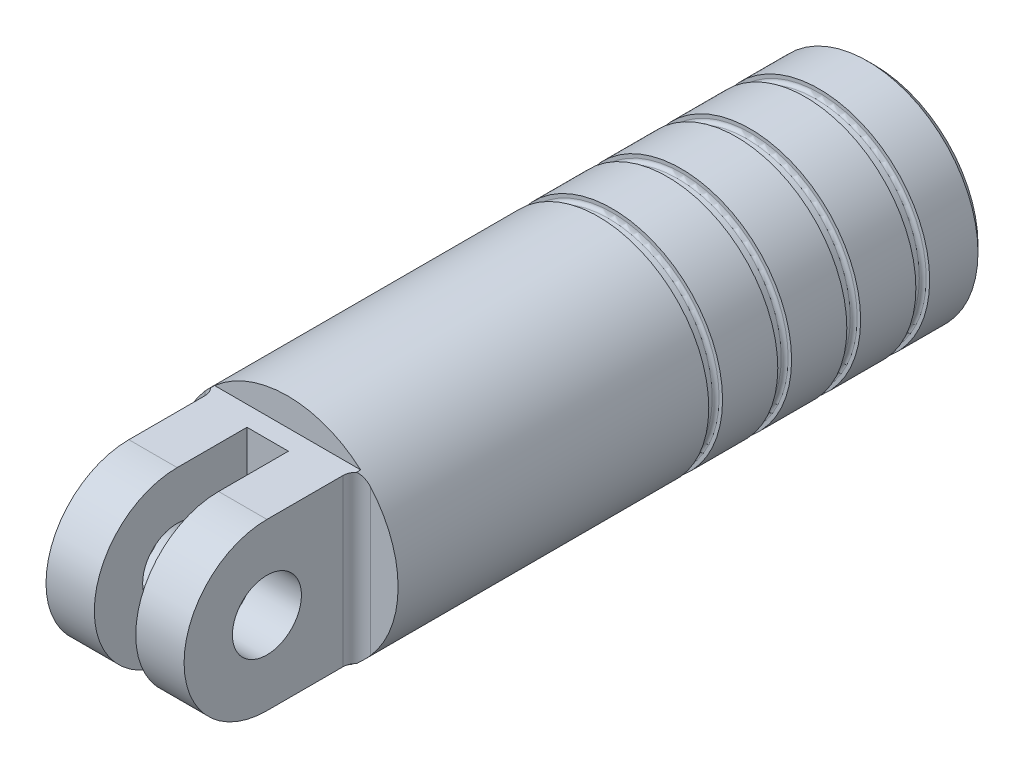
ISO-10303-21;
HEADER;
FILE_DESCRIPTION(('STEP AP214'),'2;1');
FILE_NAME('part.step','',(''),(''),'','','');
FILE_SCHEMA(('AUTOMOTIVE_DESIGN { 1 0 10303 214 1 1 1 1 }'));
ENDSEC;
DATA;
#1=APPLICATION_CONTEXT('core data for automotive mechanical design processes');
#2=APPLICATION_PROTOCOL_DEFINITION('international standard','automotive_design',2000,#1);
#3=PRODUCT_CONTEXT('',#1,'mechanical');
#4=PRODUCT('Part','Part','',(#3));
#5=PRODUCT_RELATED_PRODUCT_CATEGORY('part','',(#4));
#6=PRODUCT_DEFINITION_FORMATION('','',#4);
#7=PRODUCT_DEFINITION_CONTEXT('part definition',#1,'design');
#8=PRODUCT_DEFINITION('design','',#6,#7);
#9=PRODUCT_DEFINITION_SHAPE('','',#8);
#10=(LENGTH_UNIT() NAMED_UNIT(*) SI_UNIT(.MILLI.,.METRE.));
#11=(NAMED_UNIT(*) PLANE_ANGLE_UNIT() SI_UNIT($,.RADIAN.));
#12=(NAMED_UNIT(*) SI_UNIT($,.STERADIAN.) SOLID_ANGLE_UNIT());
#13=UNCERTAINTY_MEASURE_WITH_UNIT(LENGTH_MEASURE(1.E-05),#10,'distance_accuracy_value','');
#14=(GEOMETRIC_REPRESENTATION_CONTEXT(3) GLOBAL_UNCERTAINTY_ASSIGNED_CONTEXT((#13)) GLOBAL_UNIT_ASSIGNED_CONTEXT((#10,
#11,#12)) REPRESENTATION_CONTEXT('',''));
#15=CARTESIAN_POINT('',(0.,0.,0.));
#16=DIRECTION('',(0.,0.,1.));
#17=DIRECTION('',(1.,0.,0.));
#18=AXIS2_PLACEMENT_3D('',#15,#16,#17);
#19=CARTESIAN_POINT('',(0.,0.,85.));
#20=DIRECTION('',(0.,0.,1.));
#21=DIRECTION('',(1.,0.,0.));
#22=AXIS2_PLACEMENT_3D('',#19,#20,#21);
#23=PLANE('',#22);
#24=DIRECTION('',(-1.,0.,0.));
#25=VECTOR('',#24,1.);
#26=CARTESIAN_POINT('',(10.,12.,85.));
#27=LINE('',#26,#25);
#28=CARTESIAN_POINT('',(10.5830052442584,12.,85.));
#29=VERTEX_POINT('',#28);
#30=CARTESIAN_POINT('',(-10.5830052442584,12.,85.));
#31=VERTEX_POINT('',#30);
#32=EDGE_CURVE('E204',#29,#31,#27,.T.);
#33=ORIENTED_EDGE('',*,*,#32,.F.);
#34=CARTESIAN_POINT('',(0.,0.,85.));
#35=DIRECTION('',(0.,0.,1.));
#36=DIRECTION('',(1.,0.,0.));
#37=AXIS2_PLACEMENT_3D('',#34,#35,#36);
#38=CIRCLE('',#37,16.);
#39=EDGE_CURVE('E216',#29,#31,#38,.T.);
#40=ORIENTED_EDGE('',*,*,#39,.T.);
#41=EDGE_LOOP('',(#33,#40));
#42=FACE_BOUND('',#41,.T.);
#43=ADVANCED_FACE('F35',(#42),#23,.T.);
#44=CARTESIAN_POINT('',(12.,-10.5830052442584,85.));
#45=VERTEX_POINT('',#44);
#46=CARTESIAN_POINT('',(12.,10.5830052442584,85.));
#47=VERTEX_POINT('',#46);
#48=EDGE_CURVE('E221',#45,#47,#38,.T.);
#49=ORIENTED_EDGE('',*,*,#48,.T.);
#50=DIRECTION('',(0.,1.,0.));
#51=VECTOR('',#50,1.);
#52=CARTESIAN_POINT('',(12.,-12.,85.));
#53=LINE('',#52,#51);
#54=EDGE_CURVE('E355',#47,#45,#53,.F.);
#55=ORIENTED_EDGE('',*,*,#54,.T.);
#56=EDGE_LOOP('',(#49,#55));
#57=FACE_BOUND('',#56,.T.);
#58=ADVANCED_FACE('F329',(#57),#23,.T.);
#59=CARTESIAN_POINT('',(-12.,10.5830052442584,85.));
#60=VERTEX_POINT('',#59);
#61=CARTESIAN_POINT('',(-12.,-10.5830052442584,85.));
#62=VERTEX_POINT('',#61);
#63=EDGE_CURVE('E220',#60,#62,#38,.T.);
#64=ORIENTED_EDGE('',*,*,#63,.T.);
#65=DIRECTION('',(0.,1.,0.));
#66=VECTOR('',#65,1.);
#67=CARTESIAN_POINT('',(-12.,0.,85.));
#68=LINE('',#67,#66);
#69=EDGE_CURVE('E243',#62,#60,#68,.T.);
#70=ORIENTED_EDGE('',*,*,#69,.T.);
#71=EDGE_LOOP('',(#64,#70));
#72=FACE_BOUND('',#71,.T.);
#73=ADVANCED_FACE('F319',(#72),#23,.T.);
#74=CARTESIAN_POINT('',(10.,0.,98.));
#75=DIRECTION('',(-1.,0.,0.));
#76=DIRECTION('',(0.,0.,1.));
#77=AXIS2_PLACEMENT_3D('',#74,#75,#76);
#78=CYLINDRICAL_SURFACE('',#77,12.);
#79=DIRECTION('',(-1.,0.,0.));
#80=VECTOR('',#79,1.);
#81=CARTESIAN_POINT('',(10.,12.,98.));
#82=LINE('',#81,#80);
#83=CARTESIAN_POINT('',(10.,12.,98.));
#84=VERTEX_POINT('',#83);
#85=CARTESIAN_POINT('',(3.,12.,98.));
#86=VERTEX_POINT('',#85);
#87=EDGE_CURVE('E202',#84,#86,#82,.T.);
#88=ORIENTED_EDGE('',*,*,#87,.T.);
#89=CARTESIAN_POINT('',(3.,0.,98.));
#90=DIRECTION('',(1.,0.,0.));
#91=DIRECTION('',(0.,0.,-1.));
#92=AXIS2_PLACEMENT_3D('',#89,#90,#91);
#93=CIRCLE('',#92,12.);
#94=CARTESIAN_POINT('',(3.,-12.,98.));
#95=VERTEX_POINT('',#94);
#96=EDGE_CURVE('E156',#86,#95,#93,.T.);
#97=ORIENTED_EDGE('',*,*,#96,.T.);
#98=DIRECTION('',(-1.,0.,0.));
#99=VECTOR('',#98,1.);
#100=CARTESIAN_POINT('',(10.,-12.,98.));
#101=LINE('',#100,#99);
#102=CARTESIAN_POINT('',(10.,-12.,98.));
#103=VERTEX_POINT('',#102);
#104=EDGE_CURVE('E210',#103,#95,#101,.T.);
#105=ORIENTED_EDGE('',*,*,#104,.F.);
#106=CARTESIAN_POINT('',(10.,0.,98.));
#107=DIRECTION('',(1.,0.,0.));
#108=DIRECTION('',(0.,0.,-1.));
#109=AXIS2_PLACEMENT_3D('',#106,#107,#108);
#110=CIRCLE('',#109,12.);
#111=EDGE_CURVE('E193',#84,#103,#110,.T.);
#112=ORIENTED_EDGE('',*,*,#111,.F.);
#113=EDGE_LOOP('',(#88,#97,#105,#112));
#114=FACE_BOUND('',#113,.T.);
#115=ADVANCED_FACE('F310',(#114),#78,.T.);
#116=CARTESIAN_POINT('',(10.,0.,98.));
#117=DIRECTION('',(-1.,0.,0.));
#118=DIRECTION('',(0.,0.,1.));
#119=AXIS2_PLACEMENT_3D('',#116,#117,#118);
#120=CYLINDRICAL_SURFACE('',#119,5.);
#121=CARTESIAN_POINT('',(3.,0.,98.));
#122=DIRECTION('',(1.,0.,0.));
#123=DIRECTION('',(0.,0.,-1.));
#124=AXIS2_PLACEMENT_3D('',#121,#122,#123);
#125=CIRCLE('',#124,5.);
#126=CARTESIAN_POINT('',(3.,0.,93.));
#127=VERTEX_POINT('',#126);
#128=EDGE_CURVE('E174',#127,#127,#125,.T.);
#129=ORIENTED_EDGE('',*,*,#128,.F.);
#130=EDGE_LOOP('',(#129));
#131=FACE_BOUND('',#130,.T.);
#132=CARTESIAN_POINT('',(10.,0.,98.));
#133=DIRECTION('',(1.,0.,0.));
#134=DIRECTION('',(0.,0.,-1.));
#135=AXIS2_PLACEMENT_3D('',#132,#133,#134);
#136=CIRCLE('',#135,5.);
#137=CARTESIAN_POINT('',(10.,0.,93.));
#138=VERTEX_POINT('',#137);
#139=EDGE_CURVE('E182',#138,#138,#136,.T.);
#140=ORIENTED_EDGE('',*,*,#139,.T.);
#141=EDGE_LOOP('',(#140));
#142=FACE_BOUND('',#141,.T.);
#143=ADVANCED_FACE('F291',(#131,#142),#120,.F.);
#144=CARTESIAN_POINT('',(-10.5830052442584,-12.,85.));
#145=VERTEX_POINT('',#144);
#146=CARTESIAN_POINT('',(10.5830052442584,-12.,85.));
#147=VERTEX_POINT('',#146);
#148=EDGE_CURVE('E217',#145,#147,#38,.T.);
#149=ORIENTED_EDGE('',*,*,#148,.T.);
#150=DIRECTION('',(-1.,0.,0.));
#151=VECTOR('',#150,1.);
#152=CARTESIAN_POINT('',(10.,-12.,85.));
#153=LINE('',#152,#151);
#154=EDGE_CURVE('E207',#147,#145,#153,.T.);
#155=ORIENTED_EDGE('',*,*,#154,.T.);
#156=EDGE_LOOP('',(#149,#155));
#157=FACE_BOUND('',#156,.T.);
#158=ADVANCED_FACE('F315',(#157),#23,.T.);
#159=CARTESIAN_POINT('',(0.,0.,38.));
#160=DIRECTION('',(0.,0.,1.));
#161=DIRECTION('',(1.,0.,0.));
#162=AXIS2_PLACEMENT_3D('',#159,#160,#161);
#163=PLANE('',#162);
#164=CARTESIAN_POINT('',(0.,0.,38.));
#165=DIRECTION('',(0.,0.,1.));
#166=DIRECTION('',(1.,0.,0.));
#167=AXIS2_PLACEMENT_3D('',#164,#165,#166);
#168=CIRCLE('',#167,15.5);
#169=CARTESIAN_POINT('',(15.5,0.,38.));
#170=VERTEX_POINT('',#169);
#171=EDGE_CURVE('E387',#170,#170,#168,.F.);
#172=ORIENTED_EDGE('',*,*,#171,.T.);
#173=EDGE_LOOP('',(#172));
#174=FACE_BOUND('',#173,.T.);
#175=CARTESIAN_POINT('',(0.,0.,38.));
#176=DIRECTION('',(0.,0.,1.));
#177=DIRECTION('',(1.,0.,0.));
#178=AXIS2_PLACEMENT_3D('',#175,#176,#177);
#179=CIRCLE('',#178,16.);
#180=CARTESIAN_POINT('',(16.,0.,38.));
#181=VERTEX_POINT('',#180);
#182=EDGE_CURVE('E225',#181,#181,#179,.T.);
#183=ORIENTED_EDGE('',*,*,#182,.T.);
#184=EDGE_LOOP('',(#183));
#185=FACE_BOUND('',#184,.T.);
#186=ADVANCED_FACE('F317',(#174,#185),#163,.T.);
#187=CARTESIAN_POINT('',(0.,0.,28.));
#188=DIRECTION('',(0.,0.,1.));
#189=DIRECTION('',(1.,0.,0.));
#190=AXIS2_PLACEMENT_3D('',#187,#188,#189);
#191=PLANE('',#190);
#192=CARTESIAN_POINT('',(0.,0.,28.));
#193=DIRECTION('',(0.,0.,1.));
#194=DIRECTION('',(1.,0.,0.));
#195=AXIS2_PLACEMENT_3D('',#192,#193,#194);
#196=CIRCLE('',#195,15.5);
#197=CARTESIAN_POINT('',(15.5,0.,28.));
#198=VERTEX_POINT('',#197);
#199=EDGE_CURVE('E393',#198,#198,#196,.F.);
#200=ORIENTED_EDGE('',*,*,#199,.T.);
#201=EDGE_LOOP('',(#200));
#202=FACE_BOUND('',#201,.T.);
#203=CARTESIAN_POINT('',(0.,0.,28.));
#204=DIRECTION('',(0.,0.,1.));
#205=DIRECTION('',(1.,0.,0.));
#206=AXIS2_PLACEMENT_3D('',#203,#204,#205);
#207=CIRCLE('',#206,16.);
#208=CARTESIAN_POINT('',(16.,0.,28.));
#209=VERTEX_POINT('',#208);
#210=EDGE_CURVE('E231',#209,#209,#207,.T.);
#211=ORIENTED_EDGE('',*,*,#210,.T.);
#212=EDGE_LOOP('',(#211));
#213=FACE_BOUND('',#212,.T.);
#214=ADVANCED_FACE('F324',(#202,#213),#191,.T.);
#215=CARTESIAN_POINT('',(0.,0.,18.));
#216=DIRECTION('',(0.,0.,1.));
#217=DIRECTION('',(1.,0.,0.));
#218=AXIS2_PLACEMENT_3D('',#215,#216,#217);
#219=PLANE('',#218);
#220=CARTESIAN_POINT('',(0.,0.,18.));
#221=DIRECTION('',(0.,0.,1.));
#222=DIRECTION('',(1.,0.,0.));
#223=AXIS2_PLACEMENT_3D('',#220,#221,#222);
#224=CIRCLE('',#223,15.5);
#225=CARTESIAN_POINT('',(15.5,0.,18.));
#226=VERTEX_POINT('',#225);
#227=EDGE_CURVE('E399',#226,#226,#224,.F.);
#228=ORIENTED_EDGE('',*,*,#227,.T.);
#229=EDGE_LOOP('',(#228));
#230=FACE_BOUND('',#229,.T.);
#231=CARTESIAN_POINT('',(0.,0.,18.));
#232=DIRECTION('',(0.,0.,1.));
#233=DIRECTION('',(1.,0.,0.));
#234=AXIS2_PLACEMENT_3D('',#231,#232,#233);
#235=CIRCLE('',#234,16.);
#236=CARTESIAN_POINT('',(16.,0.,18.));
#237=VERTEX_POINT('',#236);
#238=EDGE_CURVE('E237',#237,#237,#235,.T.);
#239=ORIENTED_EDGE('',*,*,#238,.T.);
#240=EDGE_LOOP('',(#239));
#241=FACE_BOUND('',#240,.T.);
#242=ADVANCED_FACE('F495',(#230,#241),#219,.T.);
#243=CARTESIAN_POINT('',(0.,0.,8.));
#244=DIRECTION('',(0.,0.,1.));
#245=DIRECTION('',(1.,0.,0.));
#246=AXIS2_PLACEMENT_3D('',#243,#244,#245);
#247=PLANE('',#246);
#248=CARTESIAN_POINT('',(0.,0.,8.));
#249=DIRECTION('',(0.,0.,1.));
#250=DIRECTION('',(1.,0.,0.));
#251=AXIS2_PLACEMENT_3D('',#248,#249,#250);
#252=CIRCLE('',#251,15.5);
#253=CARTESIAN_POINT('',(15.5,0.,8.));
#254=VERTEX_POINT('',#253);
#255=EDGE_CURVE('E381',#254,#254,#252,.F.);
#256=ORIENTED_EDGE('',*,*,#255,.T.);
#257=EDGE_LOOP('',(#256));
#258=FACE_BOUND('',#257,.T.);
#259=CARTESIAN_POINT('',(0.,0.,8.));
#260=DIRECTION('',(0.,0.,1.));
#261=DIRECTION('',(1.,0.,0.));
#262=AXIS2_PLACEMENT_3D('',#259,#260,#261);
#263=CIRCLE('',#262,16.);
#264=CARTESIAN_POINT('',(16.,0.,8.));
#265=VERTEX_POINT('',#264);
#266=EDGE_CURVE('E240',#265,#265,#263,.T.);
#267=ORIENTED_EDGE('',*,*,#266,.T.);
#268=EDGE_LOOP('',(#267));
#269=FACE_BOUND('',#268,.T.);
#270=ADVANCED_FACE('F493',(#258,#269),#247,.T.);
#271=CARTESIAN_POINT('',(0.,0.,8.));
#272=DIRECTION('',(0.,0.,-1.));
#273=DIRECTION('',(-1.,0.,0.));
#274=AXIS2_PLACEMENT_3D('',#271,#272,#273);
#275=CYLINDRICAL_SURFACE('',#274,16.);
#276=CARTESIAN_POINT('',(0.,0.,1.));
#277=DIRECTION('',(0.,0.,1.));
#278=DIRECTION('',(1.,0.,0.));
#279=AXIS2_PLACEMENT_3D('',#276,#277,#278);
#280=CIRCLE('',#279,16.);
#281=CARTESIAN_POINT('',(16.,0.,1.));
#282=VERTEX_POINT('',#281);
#283=EDGE_CURVE('E43',#282,#282,#280,.T.);
#284=ORIENTED_EDGE('',*,*,#283,.T.);
#285=EDGE_LOOP('',(#284));
#286=FACE_BOUND('',#285,.T.);
#287=ORIENTED_EDGE('',*,*,#266,.F.);
#288=EDGE_LOOP('',(#287));
#289=FACE_BOUND('',#288,.T.);
#290=ADVANCED_FACE('F37',(#286,#289),#275,.T.);
#291=CARTESIAN_POINT('',(0.,0.,0.));
#292=DIRECTION('',(0.,0.,1.));
#293=DIRECTION('',(1.,0.,0.));
#294=AXIS2_PLACEMENT_3D('',#291,#292,#293);
#295=PLANE('',#294);
#296=CARTESIAN_POINT('',(0.,0.,0.));
#297=DIRECTION('',(0.,0.,1.));
#298=DIRECTION('',(1.,0.,0.));
#299=AXIS2_PLACEMENT_3D('',#296,#297,#298);
#300=CIRCLE('',#299,15.);
#301=CARTESIAN_POINT('',(15.,0.,0.));
#302=VERTEX_POINT('',#301);
#303=EDGE_CURVE('E11',#302,#302,#300,.F.);
#304=ORIENTED_EDGE('',*,*,#303,.T.);
#305=EDGE_LOOP('',(#304));
#306=FACE_BOUND('',#305,.T.);
#307=ADVANCED_FACE('F479',(#306),#295,.F.);
#308=CARTESIAN_POINT('',(0.,0.,10.));
#309=DIRECTION('',(0.,0.,-1.));
#310=DIRECTION('',(-1.,0.,0.));
#311=AXIS2_PLACEMENT_3D('',#308,#309,#310);
#312=CYLINDRICAL_SURFACE('',#311,15.);
#313=CARTESIAN_POINT('',(0.,0.,9.5));
#314=DIRECTION('',(0.,0.,1.));
#315=DIRECTION('',(1.,0.,0.));
#316=AXIS2_PLACEMENT_3D('',#313,#314,#315);
#317=CIRCLE('',#316,15.);
#318=CARTESIAN_POINT('',(15.,0.,9.5));
#319=VERTEX_POINT('',#318);
#320=EDGE_CURVE('E423',#319,#319,#317,.F.);
#321=ORIENTED_EDGE('',*,*,#320,.T.);
#322=EDGE_LOOP('',(#321));
#323=FACE_BOUND('',#322,.T.);
#324=CARTESIAN_POINT('',(0.,0.,8.5));
#325=DIRECTION('',(0.,0.,1.));
#326=DIRECTION('',(1.,0.,0.));
#327=AXIS2_PLACEMENT_3D('',#324,#325,#326);
#328=CIRCLE('',#327,15.);
#329=CARTESIAN_POINT('',(15.,0.,8.5));
#330=VERTEX_POINT('',#329);
#331=EDGE_CURVE('E378',#330,#330,#328,.T.);
#332=ORIENTED_EDGE('',*,*,#331,.T.);
#333=EDGE_LOOP('',(#332));
#334=FACE_BOUND('',#333,.T.);
#335=ADVANCED_FACE('F476',(#323,#334),#312,.T.);
#336=CARTESIAN_POINT('',(0.,0.,10.));
#337=DIRECTION('',(0.,0.,1.));
#338=DIRECTION('',(1.,0.,0.));
#339=AXIS2_PLACEMENT_3D('',#336,#337,#338);
#340=PLANE('',#339);
#341=CARTESIAN_POINT('',(0.,0.,10.));
#342=DIRECTION('',(0.,0.,1.));
#343=DIRECTION('',(1.,0.,0.));
#344=AXIS2_PLACEMENT_3D('',#341,#342,#343);
#345=CIRCLE('',#344,15.5);
#346=CARTESIAN_POINT('',(15.5,0.,10.));
#347=VERTEX_POINT('',#346);
#348=EDGE_CURVE('E420',#347,#347,#345,.T.);
#349=ORIENTED_EDGE('',*,*,#348,.T.);
#350=EDGE_LOOP('',(#349));
#351=FACE_BOUND('',#350,.T.);
#352=CARTESIAN_POINT('',(0.,0.,10.));
#353=DIRECTION('',(0.,0.,1.));
#354=DIRECTION('',(1.,0.,0.));
#355=AXIS2_PLACEMENT_3D('',#352,#353,#354);
#356=CIRCLE('',#355,16.);
#357=CARTESIAN_POINT('',(16.,0.,10.));
#358=VERTEX_POINT('',#357);
#359=EDGE_CURVE('E234',#358,#358,#356,.T.);
#360=ORIENTED_EDGE('',*,*,#359,.F.);
#361=EDGE_LOOP('',(#360));
#362=FACE_BOUND('',#361,.T.);
#363=ADVANCED_FACE('F478',(#351,#362),#340,.F.);
#364=CARTESIAN_POINT('',(0.,0.,18.));
#365=DIRECTION('',(0.,0.,-1.));
#366=DIRECTION('',(-1.,0.,0.));
#367=AXIS2_PLACEMENT_3D('',#364,#365,#366);
#368=CYLINDRICAL_SURFACE('',#367,16.);
#369=ORIENTED_EDGE('',*,*,#238,.F.);
#370=EDGE_LOOP('',(#369));
#371=FACE_BOUND('',#370,.T.);
#372=ORIENTED_EDGE('',*,*,#359,.T.);
#373=EDGE_LOOP('',(#372));
#374=FACE_BOUND('',#373,.T.);
#375=ADVANCED_FACE('F486',(#371,#374),#368,.T.);
#376=CARTESIAN_POINT('',(0.,0.,20.));
#377=DIRECTION('',(0.,0.,-1.));
#378=DIRECTION('',(-1.,0.,0.));
#379=AXIS2_PLACEMENT_3D('',#376,#377,#378);
#380=CYLINDRICAL_SURFACE('',#379,15.);
#381=CARTESIAN_POINT('',(0.,0.,19.5));
#382=DIRECTION('',(0.,0.,1.));
#383=DIRECTION('',(1.,0.,0.));
#384=AXIS2_PLACEMENT_3D('',#381,#382,#383);
#385=CIRCLE('',#384,15.);
#386=CARTESIAN_POINT('',(15.,0.,19.5));
#387=VERTEX_POINT('',#386);
#388=EDGE_CURVE('E417',#387,#387,#385,.F.);
#389=ORIENTED_EDGE('',*,*,#388,.T.);
#390=EDGE_LOOP('',(#389));
#391=FACE_BOUND('',#390,.T.);
#392=CARTESIAN_POINT('',(0.,0.,18.5));
#393=DIRECTION('',(0.,0.,1.));
#394=DIRECTION('',(1.,0.,0.));
#395=AXIS2_PLACEMENT_3D('',#392,#393,#394);
#396=CIRCLE('',#395,15.);
#397=CARTESIAN_POINT('',(15.,0.,18.5));
#398=VERTEX_POINT('',#397);
#399=EDGE_CURVE('E396',#398,#398,#396,.T.);
#400=ORIENTED_EDGE('',*,*,#399,.T.);
#401=EDGE_LOOP('',(#400));
#402=FACE_BOUND('',#401,.T.);
#403=ADVANCED_FACE('F511',(#391,#402),#380,.T.);
#404=CARTESIAN_POINT('',(0.,0.,20.));
#405=DIRECTION('',(0.,0.,1.));
#406=DIRECTION('',(1.,0.,0.));
#407=AXIS2_PLACEMENT_3D('',#404,#405,#406);
#408=PLANE('',#407);
#409=CARTESIAN_POINT('',(0.,0.,20.));
#410=DIRECTION('',(0.,0.,1.));
#411=DIRECTION('',(1.,0.,0.));
#412=AXIS2_PLACEMENT_3D('',#409,#410,#411);
#413=CIRCLE('',#412,15.5);
#414=CARTESIAN_POINT('',(15.5,0.,20.));
#415=VERTEX_POINT('',#414);
#416=EDGE_CURVE('E414',#415,#415,#413,.T.);
#417=ORIENTED_EDGE('',*,*,#416,.T.);
#418=EDGE_LOOP('',(#417));
#419=FACE_BOUND('',#418,.T.);
#420=CARTESIAN_POINT('',(0.,0.,20.));
#421=DIRECTION('',(0.,0.,1.));
#422=DIRECTION('',(1.,0.,0.));
#423=AXIS2_PLACEMENT_3D('',#420,#421,#422);
#424=CIRCLE('',#423,16.);
#425=CARTESIAN_POINT('',(16.,0.,20.));
#426=VERTEX_POINT('',#425);
#427=EDGE_CURVE('E228',#426,#426,#424,.T.);
#428=ORIENTED_EDGE('',*,*,#427,.F.);
#429=EDGE_LOOP('',(#428));
#430=FACE_BOUND('',#429,.T.);
#431=ADVANCED_FACE('F514',(#419,#430),#408,.F.);
#432=CARTESIAN_POINT('',(0.,0.,28.));
#433=DIRECTION('',(0.,0.,-1.));
#434=DIRECTION('',(-1.,0.,0.));
#435=AXIS2_PLACEMENT_3D('',#432,#433,#434);
#436=CYLINDRICAL_SURFACE('',#435,16.);
#437=ORIENTED_EDGE('',*,*,#210,.F.);
#438=EDGE_LOOP('',(#437));
#439=FACE_BOUND('',#438,.T.);
#440=ORIENTED_EDGE('',*,*,#427,.T.);
#441=EDGE_LOOP('',(#440));
#442=FACE_BOUND('',#441,.T.);
#443=ADVANCED_FACE('F516',(#439,#442),#436,.T.);
#444=CARTESIAN_POINT('',(0.,0.,30.));
#445=DIRECTION('',(0.,0.,-1.));
#446=DIRECTION('',(-1.,0.,0.));
#447=AXIS2_PLACEMENT_3D('',#444,#445,#446);
#448=CYLINDRICAL_SURFACE('',#447,15.);
#449=CARTESIAN_POINT('',(0.,0.,29.5));
#450=DIRECTION('',(0.,0.,1.));
#451=DIRECTION('',(1.,0.,0.));
#452=AXIS2_PLACEMENT_3D('',#449,#450,#451);
#453=CIRCLE('',#452,15.);
#454=CARTESIAN_POINT('',(15.,0.,29.5));
#455=VERTEX_POINT('',#454);
#456=EDGE_CURVE('E411',#455,#455,#453,.F.);
#457=ORIENTED_EDGE('',*,*,#456,.T.);
#458=EDGE_LOOP('',(#457));
#459=FACE_BOUND('',#458,.T.);
#460=CARTESIAN_POINT('',(0.,0.,28.5));
#461=DIRECTION('',(0.,0.,1.));
#462=DIRECTION('',(1.,0.,0.));
#463=AXIS2_PLACEMENT_3D('',#460,#461,#462);
#464=CIRCLE('',#463,15.);
#465=CARTESIAN_POINT('',(15.,0.,28.5));
#466=VERTEX_POINT('',#465);
#467=EDGE_CURVE('E390',#466,#466,#464,.T.);
#468=ORIENTED_EDGE('',*,*,#467,.T.);
#469=EDGE_LOOP('',(#468));
#470=FACE_BOUND('',#469,.T.);
#471=ADVANCED_FACE('F518',(#459,#470),#448,.T.);
#472=CARTESIAN_POINT('',(0.,0.,30.));
#473=DIRECTION('',(0.,0.,1.));
#474=DIRECTION('',(1.,0.,0.));
#475=AXIS2_PLACEMENT_3D('',#472,#473,#474);
#476=PLANE('',#475);
#477=CARTESIAN_POINT('',(0.,0.,30.));
#478=DIRECTION('',(0.,0.,1.));
#479=DIRECTION('',(1.,0.,0.));
#480=AXIS2_PLACEMENT_3D('',#477,#478,#479);
#481=CIRCLE('',#480,15.5);
#482=CARTESIAN_POINT('',(15.5,0.,30.));
#483=VERTEX_POINT('',#482);
#484=EDGE_CURVE('E408',#483,#483,#481,.T.);
#485=ORIENTED_EDGE('',*,*,#484,.T.);
#486=EDGE_LOOP('',(#485));
#487=FACE_BOUND('',#486,.T.);
#488=CARTESIAN_POINT('',(0.,0.,30.));
#489=DIRECTION('',(0.,0.,1.));
#490=DIRECTION('',(1.,0.,0.));
#491=AXIS2_PLACEMENT_3D('',#488,#489,#490);
#492=CIRCLE('',#491,16.);
#493=CARTESIAN_POINT('',(16.,0.,30.));
#494=VERTEX_POINT('',#493);
#495=EDGE_CURVE('E222',#494,#494,#492,.T.);
#496=ORIENTED_EDGE('',*,*,#495,.F.);
#497=EDGE_LOOP('',(#496));
#498=FACE_BOUND('',#497,.T.);
#499=ADVANCED_FACE('F526',(#487,#498),#476,.F.);
#500=CARTESIAN_POINT('',(0.,0.,38.));
#501=DIRECTION('',(0.,0.,-1.));
#502=DIRECTION('',(-1.,0.,0.));
#503=AXIS2_PLACEMENT_3D('',#500,#501,#502);
#504=CYLINDRICAL_SURFACE('',#503,16.);
#505=ORIENTED_EDGE('',*,*,#182,.F.);
#506=EDGE_LOOP('',(#505));
#507=FACE_BOUND('',#506,.T.);
#508=ORIENTED_EDGE('',*,*,#495,.T.);
#509=EDGE_LOOP('',(#508));
#510=FACE_BOUND('',#509,.T.);
#511=ADVANCED_FACE('F528',(#507,#510),#504,.T.);
#512=CARTESIAN_POINT('',(0.,0.,40.));
#513=DIRECTION('',(0.,0.,-1.));
#514=DIRECTION('',(-1.,0.,0.));
#515=AXIS2_PLACEMENT_3D('',#512,#513,#514);
#516=CYLINDRICAL_SURFACE('',#515,15.);
#517=CARTESIAN_POINT('',(0.,0.,39.5));
#518=DIRECTION('',(0.,0.,1.));
#519=DIRECTION('',(1.,0.,0.));
#520=AXIS2_PLACEMENT_3D('',#517,#518,#519);
#521=CIRCLE('',#520,15.);
#522=CARTESIAN_POINT('',(15.,0.,39.5));
#523=VERTEX_POINT('',#522);
#524=EDGE_CURVE('E405',#523,#523,#521,.F.);
#525=ORIENTED_EDGE('',*,*,#524,.T.);
#526=EDGE_LOOP('',(#525));
#527=FACE_BOUND('',#526,.T.);
#528=CARTESIAN_POINT('',(0.,0.,38.5));
#529=DIRECTION('',(0.,0.,1.));
#530=DIRECTION('',(1.,0.,0.));
#531=AXIS2_PLACEMENT_3D('',#528,#529,#530);
#532=CIRCLE('',#531,15.);
#533=CARTESIAN_POINT('',(15.,0.,38.5));
#534=VERTEX_POINT('',#533);
#535=EDGE_CURVE('E384',#534,#534,#532,.T.);
#536=ORIENTED_EDGE('',*,*,#535,.T.);
#537=EDGE_LOOP('',(#536));
#538=FACE_BOUND('',#537,.T.);
#539=ADVANCED_FACE('F313',(#527,#538),#516,.T.);
#540=CARTESIAN_POINT('',(0.,0.,40.));
#541=DIRECTION('',(0.,0.,1.));
#542=DIRECTION('',(1.,0.,0.));
#543=AXIS2_PLACEMENT_3D('',#540,#541,#542);
#544=PLANE('',#543);
#545=CARTESIAN_POINT('',(0.,0.,40.));
#546=DIRECTION('',(0.,0.,1.));
#547=DIRECTION('',(1.,0.,0.));
#548=AXIS2_PLACEMENT_3D('',#545,#546,#547);
#549=CIRCLE('',#548,15.5);
#550=CARTESIAN_POINT('',(15.5,0.,40.));
#551=VERTEX_POINT('',#550);
#552=EDGE_CURVE('E402',#551,#551,#549,.T.);
#553=ORIENTED_EDGE('',*,*,#552,.T.);
#554=EDGE_LOOP('',(#553));
#555=FACE_BOUND('',#554,.T.);
#556=CARTESIAN_POINT('',(0.,0.,40.));
#557=DIRECTION('',(0.,0.,1.));
#558=DIRECTION('',(1.,0.,0.));
#559=AXIS2_PLACEMENT_3D('',#556,#557,#558);
#560=CIRCLE('',#559,16.);
#561=CARTESIAN_POINT('',(16.,0.,40.));
#562=VERTEX_POINT('',#561);
#563=EDGE_CURVE('E213',#562,#562,#560,.T.);
#564=ORIENTED_EDGE('',*,*,#563,.F.);
#565=EDGE_LOOP('',(#564));
#566=FACE_BOUND('',#565,.T.);
#567=ADVANCED_FACE('F311',(#555,#566),#544,.F.);
#568=CARTESIAN_POINT('',(0.,0.,85.));
#569=DIRECTION('',(0.,0.,-1.));
#570=DIRECTION('',(-1.,0.,0.));
#571=AXIS2_PLACEMENT_3D('',#568,#569,#570);
#572=CYLINDRICAL_SURFACE('',#571,16.);
#573=ORIENTED_EDGE('',*,*,#63,.F.);
#574=CARTESIAN_POINT('',(-12.,10.5830052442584,85.));
#575=CARTESIAN_POINT('',(-11.9265042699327,10.6663592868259,85.0000211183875));
#576=CARTESIAN_POINT('',(-11.8520811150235,10.7489794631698,85.0040552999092));
#577=CARTESIAN_POINT('',(-11.7018167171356,10.9123662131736,85.020898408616));
#578=CARTESIAN_POINT('',(-11.6259724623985,10.9931277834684,85.0337286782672));
#579=CARTESIAN_POINT('',(-11.4762260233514,11.1493300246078,85.0683282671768));
#580=CARTESIAN_POINT('',(-11.4023442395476,11.2248583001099,85.0897826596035));
#581=CARTESIAN_POINT('',(-11.2549193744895,11.3726726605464,85.1423188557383));
#582=CARTESIAN_POINT('',(-11.1813760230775,11.444961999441,85.1733907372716));
#583=CARTESIAN_POINT('',(-11.0162112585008,11.6042854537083,85.2556473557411));
#584=CARTESIAN_POINT('',(-10.924963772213,11.6901503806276,85.3099799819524));
#585=CARTESIAN_POINT('',(-10.7910615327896,11.8134165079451,85.40577019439));
#586=CARTESIAN_POINT('',(-10.7464649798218,11.8539836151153,85.4405307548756));
#587=CARTESIAN_POINT('',(-10.6590989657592,11.9326057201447,85.5149821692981));
#588=CARTESIAN_POINT('',(-10.6163315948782,11.9706578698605,85.5546784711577));
#589=CARTESIAN_POINT('',(-10.574756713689,12.0072694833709,85.5969028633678));
#590=B_SPLINE_CURVE_WITH_KNOTS('',3,(#574,#575,#576,#577,#578,#579,#580,#581,#582,#583,#584,
#585,#586,#587,#588,#589),.UNSPECIFIED.,.F.,.F.,(4,2,2,2,2,2,2,4),(0.,0.333401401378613,
0.667614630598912,0.99059522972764,1.31324372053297,1.72139454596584,1.92995101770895,
2.13873976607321),.UNSPECIFIED.);
#591=CARTESIAN_POINT('',(-10.5830052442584,12.,85.5885731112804));
#592=VERTEX_POINT('',#591);
#593=EDGE_CURVE('E259',#60,#592,#590,.T.);
#594=ORIENTED_EDGE('',*,*,#593,.T.);
#595=DIRECTION('',(0.,0.,-1.));
#596=VECTOR('',#595,1.);
#597=CARTESIAN_POINT('',(-10.5830052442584,12.,85.5885731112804));
#598=LINE('',#597,#596);
#599=EDGE_CURVE('E347',#31,#592,#598,.F.);
#600=ORIENTED_EDGE('',*,*,#599,.F.);
#601=ORIENTED_EDGE('',*,*,#39,.F.);
#602=DIRECTION('',(0.,0.,-1.));
#603=VECTOR('',#602,1.);
#604=CARTESIAN_POINT('',(10.5830052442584,12.,85.));
#605=LINE('',#604,#603);
#606=CARTESIAN_POINT('',(10.5830052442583,12.0000000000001,85.5885731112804));
#607=VERTEX_POINT('',#606);
#608=EDGE_CURVE('E349',#29,#607,#605,.F.);
#609=ORIENTED_EDGE('',*,*,#608,.T.);
#610=CARTESIAN_POINT('',(10.2929349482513,12.2497138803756,85.9579208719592));
#611=CARTESIAN_POINT('',(10.3407494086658,12.2095522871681,85.8795852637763));
#612=CARTESIAN_POINT('',(10.3928604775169,12.1652743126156,85.8063381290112));
#613=CARTESIAN_POINT('',(10.5032003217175,12.0701263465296,85.6706552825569));
#614=CARTESIAN_POINT('',(10.5613724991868,12.0193164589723,85.6081318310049));
#615=CARTESIAN_POINT('',(10.713548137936,11.8842288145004,85.4634183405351));
#616=CARTESIAN_POINT('',(10.8105080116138,11.7962444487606,85.3878086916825));
#617=CARTESIAN_POINT('',(11.0102958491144,11.6100051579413,85.2579245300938));
#618=CARTESIAN_POINT('',(11.113166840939,11.5116689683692,85.2038376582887));
#619=CARTESIAN_POINT('',(11.2829060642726,11.3448093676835,85.1315925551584));
#620=CARTESIAN_POINT('',(11.3493723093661,11.2783309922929,85.1075121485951));
#621=CARTESIAN_POINT('',(11.4822811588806,11.1429892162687,85.0669203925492));
#622=CARTESIAN_POINT('',(11.5487237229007,11.0741243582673,85.0504137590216));
#623=CARTESIAN_POINT('',(11.6799437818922,10.9356236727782,85.0246598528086));
#624=CARTESIAN_POINT('',(11.7447310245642,10.8660170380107,85.0153024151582));
#625=CARTESIAN_POINT('',(11.8732337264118,10.725456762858,85.0029832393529));
#626=CARTESIAN_POINT('',(11.9369506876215,10.6545053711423,85.0000116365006));
#627=CARTESIAN_POINT('',(12.,10.5830052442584,85.));
#628=B_SPLINE_CURVE_WITH_KNOTS('',3,(#610,#611,#612,#613,#614,#615,#616,#617,#618,#619,#620,
#621,#622,#623,#624,#625,#626,#627),.UNSPECIFIED.,.F.,.F.,(4,2,2,2,2,2,2,2,4),(0.,
0.299810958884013,0.597037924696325,1.04817006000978,1.50315335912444,1.79397413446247,
2.08497575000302,2.37139734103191,2.65737615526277),.UNSPECIFIED.);
#629=EDGE_CURVE('E364',#607,#47,#628,.T.);
#630=ORIENTED_EDGE('',*,*,#629,.T.);
#631=ORIENTED_EDGE('',*,*,#48,.F.);
#632=CARTESIAN_POINT('',(12.,-10.5830052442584,85.));
#633=CARTESIAN_POINT('',(11.9265042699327,-10.6663592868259,85.0000211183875));
#634=CARTESIAN_POINT('',(11.8520811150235,-10.7489794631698,85.0040552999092));
#635=CARTESIAN_POINT('',(11.7018167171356,-10.9123662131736,85.020898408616));
#636=CARTESIAN_POINT('',(11.6259724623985,-10.9931277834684,85.0337286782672));
#637=CARTESIAN_POINT('',(11.4762260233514,-11.1493300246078,85.0683282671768));
#638=CARTESIAN_POINT('',(11.4023442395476,-11.2248583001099,85.0897826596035));
#639=CARTESIAN_POINT('',(11.2549193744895,-11.3726726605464,85.1423188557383));
#640=CARTESIAN_POINT('',(11.1813760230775,-11.444961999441,85.1733907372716));
#641=CARTESIAN_POINT('',(11.0162112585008,-11.6042854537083,85.2556473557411));
#642=CARTESIAN_POINT('',(10.924963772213,-11.6901503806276,85.3099799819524));
#643=CARTESIAN_POINT('',(10.7910615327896,-11.8134165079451,85.40577019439));
#644=CARTESIAN_POINT('',(10.7464649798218,-11.8539836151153,85.4405307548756));
#645=CARTESIAN_POINT('',(10.6590989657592,-11.9326057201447,85.5149821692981));
#646=CARTESIAN_POINT('',(10.6163315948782,-11.9706578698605,85.5546784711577));
#647=CARTESIAN_POINT('',(10.574756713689,-12.0072694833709,85.5969028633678));
#648=B_SPLINE_CURVE_WITH_KNOTS('',3,(#632,#633,#634,#635,#636,#637,#638,#639,#640,#641,#642,
#643,#644,#645,#646,#647),.UNSPECIFIED.,.F.,.F.,(4,2,2,2,2,2,2,4),(0.,0.333401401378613,
0.667614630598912,0.99059522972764,1.31324372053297,1.72139454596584,1.92995101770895,
2.13873976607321),.UNSPECIFIED.);
#649=CARTESIAN_POINT('',(10.5830052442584,-12.,85.5885731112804));
#650=VERTEX_POINT('',#649);
#651=EDGE_CURVE('E50',#45,#650,#648,.T.);
#652=ORIENTED_EDGE('',*,*,#651,.T.);
#653=DIRECTION('',(0.,0.,-1.));
#654=VECTOR('',#653,1.);
#655=CARTESIAN_POINT('',(10.5830052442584,-12.,85.5885731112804));
#656=LINE('',#655,#654);
#657=EDGE_CURVE('E376',#147,#650,#656,.F.);
#658=ORIENTED_EDGE('',*,*,#657,.F.);
#659=ORIENTED_EDGE('',*,*,#148,.F.);
#660=DIRECTION('',(0.,0.,-1.));
#661=VECTOR('',#660,1.);
#662=CARTESIAN_POINT('',(-10.5830052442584,-12.,85.));
#663=LINE('',#662,#661);
#664=CARTESIAN_POINT('',(-10.5830052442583,-12.0000000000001,85.5885731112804));
#665=VERTEX_POINT('',#664);
#666=EDGE_CURVE('E352',#145,#665,#663,.F.);
#667=ORIENTED_EDGE('',*,*,#666,.T.);
#668=CARTESIAN_POINT('',(-10.2929349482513,-12.2497138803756,85.9579208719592));
#669=CARTESIAN_POINT('',(-10.3407494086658,-12.2095522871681,85.8795852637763));
#670=CARTESIAN_POINT('',(-10.3928604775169,-12.1652743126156,85.8063381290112));
#671=CARTESIAN_POINT('',(-10.5032003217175,-12.0701263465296,85.6706552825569));
#672=CARTESIAN_POINT('',(-10.5613724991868,-12.0193164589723,85.6081318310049));
#673=CARTESIAN_POINT('',(-10.713548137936,-11.8842288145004,85.4634183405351));
#674=CARTESIAN_POINT('',(-10.8105080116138,-11.7962444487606,85.3878086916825));
#675=CARTESIAN_POINT('',(-11.0102958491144,-11.6100051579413,85.2579245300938));
#676=CARTESIAN_POINT('',(-11.113166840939,-11.5116689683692,85.2038376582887));
#677=CARTESIAN_POINT('',(-11.2829060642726,-11.3448093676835,85.1315925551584));
#678=CARTESIAN_POINT('',(-11.3493723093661,-11.2783309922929,85.1075121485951));
#679=CARTESIAN_POINT('',(-11.4822811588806,-11.1429892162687,85.0669203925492));
#680=CARTESIAN_POINT('',(-11.5487237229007,-11.0741243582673,85.0504137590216));
#681=CARTESIAN_POINT('',(-11.6799437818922,-10.9356236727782,85.0246598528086));
#682=CARTESIAN_POINT('',(-11.7447310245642,-10.8660170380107,85.0153024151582));
#683=CARTESIAN_POINT('',(-11.8732337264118,-10.725456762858,85.0029832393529));
#684=CARTESIAN_POINT('',(-11.9369506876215,-10.6545053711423,85.0000116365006));
#685=CARTESIAN_POINT('',(-12.,-10.5830052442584,85.));
#686=B_SPLINE_CURVE_WITH_KNOTS('',3,(#668,#669,#670,#671,#672,#673,#674,#675,#676,#677,#678,
#679,#680,#681,#682,#683,#684,#685),.UNSPECIFIED.,.F.,.F.,(4,2,2,2,2,2,2,2,4),(0.,
0.299810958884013,0.597037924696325,1.04817006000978,1.50315335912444,1.79397413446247,
2.08497575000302,2.37139734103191,2.65737615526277),.UNSPECIFIED.);
#687=EDGE_CURVE('E251',#665,#62,#686,.T.);
#688=ORIENTED_EDGE('',*,*,#687,.T.);
#689=EDGE_LOOP('',(#573,#594,#600,#601,#609,#630,#631,#652,#658,#659,#667,#688));
#690=FACE_BOUND('',#689,.T.);
#691=ORIENTED_EDGE('',*,*,#563,.T.);
#692=EDGE_LOOP('',(#691));
#693=FACE_BOUND('',#692,.T.);
#694=ADVANCED_FACE('F264',(#690,#693),#572,.T.);
#695=CARTESIAN_POINT('',(10.,0.,98.));
#696=DIRECTION('',(1.,0.,0.));
#697=DIRECTION('',(0.,0.,-1.));
#698=AXIS2_PLACEMENT_3D('',#695,#696,#697);
#699=PLANE('',#698);
#700=DIRECTION('',(0.,0.,-1.));
#701=VECTOR('',#700,1.);
#702=CARTESIAN_POINT('',(10.,-12.,98.));
#703=LINE('',#702,#701);
#704=CARTESIAN_POINT('',(10.,-12.,87.));
#705=VERTEX_POINT('',#704);
#706=EDGE_CURVE('E196',#103,#705,#703,.T.);
#707=ORIENTED_EDGE('',*,*,#706,.T.);
#708=DIRECTION('',(0.,1.,0.));
#709=VECTOR('',#708,1.);
#710=CARTESIAN_POINT('',(10.,12.,87.));
#711=LINE('',#710,#709);
#712=CARTESIAN_POINT('',(10.,12.,87.));
#713=VERTEX_POINT('',#712);
#714=EDGE_CURVE('E351',#705,#713,#711,.T.);
#715=ORIENTED_EDGE('',*,*,#714,.T.);
#716=DIRECTION('',(0.,0.,1.));
#717=VECTOR('',#716,1.);
#718=CARTESIAN_POINT('',(10.,12.,98.));
#719=LINE('',#718,#717);
#720=EDGE_CURVE('E199',#713,#84,#719,.T.);
#721=ORIENTED_EDGE('',*,*,#720,.T.);
#722=ORIENTED_EDGE('',*,*,#111,.T.);
#723=EDGE_LOOP('',(#707,#715,#721,#722));
#724=FACE_BOUND('',#723,.T.);
#725=ORIENTED_EDGE('',*,*,#139,.F.);
#726=EDGE_LOOP('',(#725));
#727=FACE_BOUND('',#726,.T.);
#728=ADVANCED_FACE('F296',(#724,#727),#699,.T.);
#729=CARTESIAN_POINT('',(-10.,0.,98.));
#730=DIRECTION('',(1.,0.,0.));
#731=DIRECTION('',(0.,0.,-1.));
#732=AXIS2_PLACEMENT_3D('',#729,#730,#731);
#733=PLANE('',#732);
#734=DIRECTION('',(0.,0.,1.));
#735=VECTOR('',#734,1.);
#736=CARTESIAN_POINT('',(-10.,12.,98.));
#737=LINE('',#736,#735);
#738=CARTESIAN_POINT('',(-10.,12.,87.));
#739=VERTEX_POINT('',#738);
#740=CARTESIAN_POINT('',(-10.,12.,98.));
#741=VERTEX_POINT('',#740);
#742=EDGE_CURVE('E191',#739,#741,#737,.T.);
#743=ORIENTED_EDGE('',*,*,#742,.F.);
#744=DIRECTION('',(0.,1.,0.));
#745=VECTOR('',#744,1.);
#746=CARTESIAN_POINT('',(-10.,0.,87.));
#747=LINE('',#746,#745);
#748=CARTESIAN_POINT('',(-10.,-12.,87.));
#749=VERTEX_POINT('',#748);
#750=EDGE_CURVE('E249',#739,#749,#747,.F.);
#751=ORIENTED_EDGE('',*,*,#750,.T.);
#752=DIRECTION('',(0.,0.,-1.));
#753=VECTOR('',#752,1.);
#754=CARTESIAN_POINT('',(-10.,-12.,98.));
#755=LINE('',#754,#753);
#756=CARTESIAN_POINT('',(-10.,-12.,98.));
#757=VERTEX_POINT('',#756);
#758=EDGE_CURVE('E188',#757,#749,#755,.T.);
#759=ORIENTED_EDGE('',*,*,#758,.F.);
#760=CARTESIAN_POINT('',(-10.,0.,98.));
#761=DIRECTION('',(1.,0.,0.));
#762=DIRECTION('',(0.,0.,-1.));
#763=AXIS2_PLACEMENT_3D('',#760,#761,#762);
#764=CIRCLE('',#763,12.);
#765=EDGE_CURVE('E185',#741,#757,#764,.T.);
#766=ORIENTED_EDGE('',*,*,#765,.F.);
#767=EDGE_LOOP('',(#743,#751,#759,#766));
#768=FACE_BOUND('',#767,.T.);
#769=CARTESIAN_POINT('',(-10.,0.,98.));
#770=DIRECTION('',(1.,0.,0.));
#771=DIRECTION('',(0.,0.,-1.));
#772=AXIS2_PLACEMENT_3D('',#769,#770,#771);
#773=CIRCLE('',#772,5.);
#774=CARTESIAN_POINT('',(-10.,0.,93.));
#775=VERTEX_POINT('',#774);
#776=EDGE_CURVE('E179',#775,#775,#773,.T.);
#777=ORIENTED_EDGE('',*,*,#776,.T.);
#778=EDGE_LOOP('',(#777));
#779=FACE_BOUND('',#778,.T.);
#780=ADVANCED_FACE('F292',(#768,#779),#733,.F.);
#781=CARTESIAN_POINT('',(-2.99999999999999,-12.,98.));
#782=VERTEX_POINT('',#781);
#783=EDGE_CURVE('E209',#782,#757,#101,.T.);
#784=ORIENTED_EDGE('',*,*,#783,.F.);
#785=CARTESIAN_POINT('',(-2.99999999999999,0.,98.));
#786=DIRECTION('',(-1.,0.,0.));
#787=DIRECTION('',(0.,0.,1.));
#788=AXIS2_PLACEMENT_3D('',#785,#786,#787);
#789=CIRCLE('',#788,12.);
#790=CARTESIAN_POINT('',(-2.99999999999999,12.,98.));
#791=VERTEX_POINT('',#790);
#792=EDGE_CURVE('E171',#782,#791,#789,.T.);
#793=ORIENTED_EDGE('',*,*,#792,.T.);
#794=EDGE_CURVE('E201',#791,#741,#82,.T.);
#795=ORIENTED_EDGE('',*,*,#794,.T.);
#796=ORIENTED_EDGE('',*,*,#765,.T.);
#797=EDGE_LOOP('',(#784,#793,#795,#796));
#798=FACE_BOUND('',#797,.T.);
#799=ADVANCED_FACE('F295',(#798),#78,.T.);
#800=CARTESIAN_POINT('',(10.,-12.,98.));
#801=DIRECTION('',(0.,1.,0.));
#802=DIRECTION('',(0.,0.,1.));
#803=AXIS2_PLACEMENT_3D('',#800,#801,#802);
#804=PLANE('',#803);
#805=ORIENTED_EDGE('',*,*,#104,.T.);
#806=DIRECTION('',(0.,0.,-1.));
#807=VECTOR('',#806,1.);
#808=CARTESIAN_POINT('',(3.,-12.,98.));
#809=LINE('',#808,#807);
#810=CARTESIAN_POINT('',(3.,-12.,87.8888888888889));
#811=VERTEX_POINT('',#810);
#812=EDGE_CURVE('E175',#95,#811,#809,.T.);
#813=ORIENTED_EDGE('',*,*,#812,.T.);
#814=DIRECTION('',(-1.,0.,0.));
#815=VECTOR('',#814,1.);
#816=CARTESIAN_POINT('',(10.,-12.,87.8888888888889));
#817=LINE('',#816,#815);
#818=CARTESIAN_POINT('',(-3.,-12.,87.8888888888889));
#819=VERTEX_POINT('',#818);
#820=EDGE_CURVE('E146',#811,#819,#817,.T.);
#821=ORIENTED_EDGE('',*,*,#820,.T.);
#822=DIRECTION('',(0.,0.,1.));
#823=VECTOR('',#822,1.);
#824=CARTESIAN_POINT('',(-2.99999999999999,-12.,98.));
#825=LINE('',#824,#823);
#826=EDGE_CURVE('E168',#819,#782,#825,.T.);
#827=ORIENTED_EDGE('',*,*,#826,.T.);
#828=ORIENTED_EDGE('',*,*,#783,.T.);
#829=ORIENTED_EDGE('',*,*,#758,.T.);
#830=CARTESIAN_POINT('',(-12.,-12.,87.));
#831=DIRECTION('',(0.,1.,0.));
#832=DIRECTION('',(0.,0.,1.));
#833=AXIS2_PLACEMENT_3D('',#830,#831,#832);
#834=CIRCLE('',#833,2.);
#835=EDGE_CURVE('E358',#749,#665,#834,.T.);
#836=ORIENTED_EDGE('',*,*,#835,.T.);
#837=ORIENTED_EDGE('',*,*,#666,.F.);
#838=ORIENTED_EDGE('',*,*,#154,.F.);
#839=ORIENTED_EDGE('',*,*,#657,.T.);
#840=CARTESIAN_POINT('',(12.,-12.,87.));
#841=DIRECTION('',(0.,1.,0.));
#842=DIRECTION('',(0.,0.,1.));
#843=AXIS2_PLACEMENT_3D('',#840,#841,#842);
#844=CIRCLE('',#843,2.);
#845=EDGE_CURVE('E373',#650,#705,#844,.T.);
#846=ORIENTED_EDGE('',*,*,#845,.T.);
#847=ORIENTED_EDGE('',*,*,#706,.F.);
#848=EDGE_LOOP('',(#805,#813,#821,#827,#828,#829,#836,#837,#838,#839,#846,#847));
#849=FACE_BOUND('',#848,.T.);
#850=ADVANCED_FACE('F303',(#849),#804,.F.);
#851=CARTESIAN_POINT('',(10.,12.,98.));
#852=DIRECTION('',(0.,-1.,0.));
#853=DIRECTION('',(0.,0.,-1.));
#854=AXIS2_PLACEMENT_3D('',#851,#852,#853);
#855=PLANE('',#854);
#856=DIRECTION('',(-1.,0.,0.));
#857=VECTOR('',#856,1.);
#858=CARTESIAN_POINT('',(-3.,12.,87.8888888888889));
#859=LINE('',#858,#857);
#860=CARTESIAN_POINT('',(3.,12.,87.8888888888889));
#861=VERTEX_POINT('',#860);
#862=CARTESIAN_POINT('',(-2.99999999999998,12.,87.8888888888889));
#863=VERTEX_POINT('',#862);
#864=EDGE_CURVE('E143',#861,#863,#859,.T.);
#865=ORIENTED_EDGE('',*,*,#864,.F.);
#866=DIRECTION('',(0.,0.,-1.));
#867=VECTOR('',#866,1.);
#868=CARTESIAN_POINT('',(3.,12.,109.888888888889));
#869=LINE('',#868,#867);
#870=EDGE_CURVE('E153',#86,#861,#869,.T.);
#871=ORIENTED_EDGE('',*,*,#870,.F.);
#872=ORIENTED_EDGE('',*,*,#87,.F.);
#873=ORIENTED_EDGE('',*,*,#720,.F.);
#874=CARTESIAN_POINT('',(12.,12.,87.));
#875=DIRECTION('',(0.,-1.,0.));
#876=DIRECTION('',(0.,0.,-1.));
#877=AXIS2_PLACEMENT_3D('',#874,#875,#876);
#878=CIRCLE('',#877,2.);
#879=EDGE_CURVE('E58',#713,#607,#878,.T.);
#880=ORIENTED_EDGE('',*,*,#879,.T.);
#881=ORIENTED_EDGE('',*,*,#608,.F.);
#882=ORIENTED_EDGE('',*,*,#32,.T.);
#883=ORIENTED_EDGE('',*,*,#599,.T.);
#884=CARTESIAN_POINT('',(-12.,12.,87.));
#885=DIRECTION('',(0.,-1.,0.));
#886=DIRECTION('',(0.,0.,-1.));
#887=AXIS2_PLACEMENT_3D('',#884,#885,#886);
#888=CIRCLE('',#887,2.);
#889=EDGE_CURVE('E857',#592,#739,#888,.T.);
#890=ORIENTED_EDGE('',*,*,#889,.T.);
#891=ORIENTED_EDGE('',*,*,#742,.T.);
#892=ORIENTED_EDGE('',*,*,#794,.F.);
#893=DIRECTION('',(0.,0.,1.));
#894=VECTOR('',#893,1.);
#895=CARTESIAN_POINT('',(-3.,12.,111.280808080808));
#896=LINE('',#895,#894);
#897=EDGE_CURVE('E159',#863,#791,#896,.T.);
#898=ORIENTED_EDGE('',*,*,#897,.F.);
#899=EDGE_LOOP('',(#865,#871,#872,#873,#880,#881,#882,#883,#890,#891,#892,#898));
#900=FACE_BOUND('',#899,.T.);
#901=ADVANCED_FACE('F162',(#900),#855,.F.);
#902=CARTESIAN_POINT('',(-2.99999999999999,0.,98.));
#903=DIRECTION('',(-1.,0.,0.));
#904=DIRECTION('',(0.,0.,1.));
#905=AXIS2_PLACEMENT_3D('',#902,#903,#904);
#906=CIRCLE('',#905,5.);
#907=CARTESIAN_POINT('',(-2.99999999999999,0.,103.));
#908=VERTEX_POINT('',#907);
#909=EDGE_CURVE('E149',#908,#908,#906,.T.);
#910=ORIENTED_EDGE('',*,*,#909,.F.);
#911=EDGE_LOOP('',(#910));
#912=FACE_BOUND('',#911,.T.);
#913=ORIENTED_EDGE('',*,*,#776,.F.);
#914=EDGE_LOOP('',(#913));
#915=FACE_BOUND('',#914,.T.);
#916=ADVANCED_FACE('F287',(#912,#915),#120,.F.);
#917=CARTESIAN_POINT('',(-3.,-16.,87.8888888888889));
#918=DIRECTION('',(0.,0.,-1.));
#919=DIRECTION('',(-1.,0.,0.));
#920=AXIS2_PLACEMENT_3D('',#917,#918,#919);
#921=PLANE('',#920);
#922=DIRECTION('',(0.,1.,0.));
#923=VECTOR('',#922,1.);
#924=CARTESIAN_POINT('',(3.,-16.,87.8888888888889));
#925=LINE('',#924,#923);
#926=EDGE_CURVE('E138',#811,#861,#925,.T.);
#927=ORIENTED_EDGE('',*,*,#926,.T.);
#928=ORIENTED_EDGE('',*,*,#864,.T.);
#929=DIRECTION('',(0.,1.,0.));
#930=VECTOR('',#929,1.);
#931=CARTESIAN_POINT('',(-3.,-16.,87.8888888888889));
#932=LINE('',#931,#930);
#933=EDGE_CURVE('E150',#819,#863,#932,.T.);
#934=ORIENTED_EDGE('',*,*,#933,.F.);
#935=ORIENTED_EDGE('',*,*,#820,.F.);
#936=EDGE_LOOP('',(#927,#928,#934,#935));
#937=FACE_BOUND('',#936,.T.);
#938=ADVANCED_FACE('F140',(#937),#921,.F.);
#939=CARTESIAN_POINT('',(3.,-16.,109.888888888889));
#940=DIRECTION('',(1.,0.,0.));
#941=DIRECTION('',(0.,0.,-1.));
#942=AXIS2_PLACEMENT_3D('',#939,#940,#941);
#943=PLANE('',#942);
#944=ORIENTED_EDGE('',*,*,#128,.T.);
#945=EDGE_LOOP('',(#944));
#946=FACE_BOUND('',#945,.T.);
#947=ORIENTED_EDGE('',*,*,#870,.T.);
#948=ORIENTED_EDGE('',*,*,#926,.F.);
#949=ORIENTED_EDGE('',*,*,#812,.F.);
#950=ORIENTED_EDGE('',*,*,#96,.F.);
#951=EDGE_LOOP('',(#947,#948,#949,#950));
#952=FACE_BOUND('',#951,.T.);
#953=ADVANCED_FACE('F154',(#946,#952),#943,.F.);
#954=CARTESIAN_POINT('',(-3.,-16.,111.280808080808));
#955=DIRECTION('',(-1.,0.,0.));
#956=DIRECTION('',(0.,0.,1.));
#957=AXIS2_PLACEMENT_3D('',#954,#955,#956);
#958=PLANE('',#957);
#959=ORIENTED_EDGE('',*,*,#909,.T.);
#960=EDGE_LOOP('',(#959));
#961=FACE_BOUND('',#960,.T.);
#962=ORIENTED_EDGE('',*,*,#826,.F.);
#963=ORIENTED_EDGE('',*,*,#933,.T.);
#964=ORIENTED_EDGE('',*,*,#897,.T.);
#965=ORIENTED_EDGE('',*,*,#792,.F.);
#966=EDGE_LOOP('',(#962,#963,#964,#965));
#967=FACE_BOUND('',#966,.T.);
#968=ADVANCED_FACE('F274',(#961,#967),#958,.F.);
#969=CARTESIAN_POINT('',(-12.,0.,87.));
#970=DIRECTION('',(0.,1.,0.));
#971=DIRECTION('',(0.,0.,1.));
#972=AXIS2_PLACEMENT_3D('',#969,#970,#971);
#973=CYLINDRICAL_SURFACE('',#972,2.);
#974=ORIENTED_EDGE('',*,*,#835,.F.);
#975=ORIENTED_EDGE('',*,*,#750,.F.);
#976=ORIENTED_EDGE('',*,*,#889,.F.);
#977=ORIENTED_EDGE('',*,*,#593,.F.);
#978=ORIENTED_EDGE('',*,*,#69,.F.);
#979=ORIENTED_EDGE('',*,*,#687,.F.);
#980=EDGE_LOOP('',(#974,#975,#976,#977,#978,#979));
#981=FACE_BOUND('',#980,.T.);
#982=ADVANCED_FACE('F268',(#981),#973,.F.);
#983=CARTESIAN_POINT('',(12.,0.,87.));
#984=DIRECTION('',(0.,-1.,0.));
#985=DIRECTION('',(0.,0.,-1.));
#986=AXIS2_PLACEMENT_3D('',#983,#984,#985);
#987=CYLINDRICAL_SURFACE('',#986,2.);
#988=ORIENTED_EDGE('',*,*,#54,.F.);
#989=ORIENTED_EDGE('',*,*,#629,.F.);
#990=ORIENTED_EDGE('',*,*,#879,.F.);
#991=ORIENTED_EDGE('',*,*,#714,.F.);
#992=ORIENTED_EDGE('',*,*,#845,.F.);
#993=ORIENTED_EDGE('',*,*,#651,.F.);
#994=EDGE_LOOP('',(#988,#989,#990,#991,#992,#993));
#995=FACE_BOUND('',#994,.T.);
#996=ADVANCED_FACE('F273',(#995),#987,.F.);
#997=CARTESIAN_POINT('',(0.,0.,8.5));
#998=DIRECTION('',(0.,0.,1.));
#999=DIRECTION('',(1.,0.,0.));
#1000=AXIS2_PLACEMENT_3D('',#997,#998,#999);
#1001=TOROIDAL_SURFACE('',#1000,15.5,0.5);
#1002=ORIENTED_EDGE('',*,*,#255,.F.);
#1003=EDGE_LOOP('',(#1002));
#1004=FACE_BOUND('',#1003,.T.);
#1005=ORIENTED_EDGE('',*,*,#331,.F.);
#1006=EDGE_LOOP('',(#1005));
#1007=FACE_BOUND('',#1006,.T.);
#1008=ADVANCED_FACE('F464',(#1004,#1007),#1001,.F.);
#1009=CARTESIAN_POINT('',(0.,0.,38.5));
#1010=DIRECTION('',(0.,0.,1.));
#1011=DIRECTION('',(1.,0.,0.));
#1012=AXIS2_PLACEMENT_3D('',#1009,#1010,#1011);
#1013=TOROIDAL_SURFACE('',#1012,15.5,0.5);
#1014=ORIENTED_EDGE('',*,*,#171,.F.);
#1015=EDGE_LOOP('',(#1014));
#1016=FACE_BOUND('',#1015,.T.);
#1017=ORIENTED_EDGE('',*,*,#535,.F.);
#1018=EDGE_LOOP('',(#1017));
#1019=FACE_BOUND('',#1018,.T.);
#1020=ADVANCED_FACE('F461',(#1016,#1019),#1013,.F.);
#1021=CARTESIAN_POINT('',(0.,0.,28.5));
#1022=DIRECTION('',(0.,0.,1.));
#1023=DIRECTION('',(1.,0.,0.));
#1024=AXIS2_PLACEMENT_3D('',#1021,#1022,#1023);
#1025=TOROIDAL_SURFACE('',#1024,15.5,0.5);
#1026=ORIENTED_EDGE('',*,*,#199,.F.);
#1027=EDGE_LOOP('',(#1026));
#1028=FACE_BOUND('',#1027,.T.);
#1029=ORIENTED_EDGE('',*,*,#467,.F.);
#1030=EDGE_LOOP('',(#1029));
#1031=FACE_BOUND('',#1030,.T.);
#1032=ADVANCED_FACE('F457',(#1028,#1031),#1025,.F.);
#1033=CARTESIAN_POINT('',(0.,0.,18.5));
#1034=DIRECTION('',(0.,0.,1.));
#1035=DIRECTION('',(1.,0.,0.));
#1036=AXIS2_PLACEMENT_3D('',#1033,#1034,#1035);
#1037=TOROIDAL_SURFACE('',#1036,15.5,0.5);
#1038=ORIENTED_EDGE('',*,*,#227,.F.);
#1039=EDGE_LOOP('',(#1038));
#1040=FACE_BOUND('',#1039,.T.);
#1041=ORIENTED_EDGE('',*,*,#399,.F.);
#1042=EDGE_LOOP('',(#1041));
#1043=FACE_BOUND('',#1042,.T.);
#1044=ADVANCED_FACE('F453',(#1040,#1043),#1037,.F.);
#1045=CARTESIAN_POINT('',(0.,0.,39.5));
#1046=DIRECTION('',(0.,0.,1.));
#1047=DIRECTION('',(1.,0.,0.));
#1048=AXIS2_PLACEMENT_3D('',#1045,#1046,#1047);
#1049=TOROIDAL_SURFACE('',#1048,15.5,0.5);
#1050=ORIENTED_EDGE('',*,*,#524,.F.);
#1051=EDGE_LOOP('',(#1050));
#1052=FACE_BOUND('',#1051,.T.);
#1053=ORIENTED_EDGE('',*,*,#552,.F.);
#1054=EDGE_LOOP('',(#1053));
#1055=FACE_BOUND('',#1054,.T.);
#1056=ADVANCED_FACE('F449',(#1052,#1055),#1049,.F.);
#1057=CARTESIAN_POINT('',(0.,0.,29.5));
#1058=DIRECTION('',(0.,0.,1.));
#1059=DIRECTION('',(1.,0.,0.));
#1060=AXIS2_PLACEMENT_3D('',#1057,#1058,#1059);
#1061=TOROIDAL_SURFACE('',#1060,15.5,0.5);
#1062=ORIENTED_EDGE('',*,*,#456,.F.);
#1063=EDGE_LOOP('',(#1062));
#1064=FACE_BOUND('',#1063,.T.);
#1065=ORIENTED_EDGE('',*,*,#484,.F.);
#1066=EDGE_LOOP('',(#1065));
#1067=FACE_BOUND('',#1066,.T.);
#1068=ADVANCED_FACE('F445',(#1064,#1067),#1061,.F.);
#1069=CARTESIAN_POINT('',(0.,0.,19.5));
#1070=DIRECTION('',(0.,0.,1.));
#1071=DIRECTION('',(1.,0.,0.));
#1072=AXIS2_PLACEMENT_3D('',#1069,#1070,#1071);
#1073=TOROIDAL_SURFACE('',#1072,15.5,0.5);
#1074=ORIENTED_EDGE('',*,*,#388,.F.);
#1075=EDGE_LOOP('',(#1074));
#1076=FACE_BOUND('',#1075,.T.);
#1077=ORIENTED_EDGE('',*,*,#416,.F.);
#1078=EDGE_LOOP('',(#1077));
#1079=FACE_BOUND('',#1078,.T.);
#1080=ADVANCED_FACE('F438',(#1076,#1079),#1073,.F.);
#1081=CARTESIAN_POINT('',(0.,0.,9.5));
#1082=DIRECTION('',(0.,0.,1.));
#1083=DIRECTION('',(1.,0.,0.));
#1084=AXIS2_PLACEMENT_3D('',#1081,#1082,#1083);
#1085=TOROIDAL_SURFACE('',#1084,15.5,0.5);
#1086=ORIENTED_EDGE('',*,*,#320,.F.);
#1087=EDGE_LOOP('',(#1086));
#1088=FACE_BOUND('',#1087,.T.);
#1089=ORIENTED_EDGE('',*,*,#348,.F.);
#1090=EDGE_LOOP('',(#1089));
#1091=FACE_BOUND('',#1090,.T.);
#1092=ADVANCED_FACE('F432',(#1088,#1091),#1085,.F.);
#1093=CARTESIAN_POINT('',(0.,0.,1.));
#1094=DIRECTION('',(0.,0.,1.));
#1095=DIRECTION('',(1.,0.,0.));
#1096=AXIS2_PLACEMENT_3D('',#1093,#1094,#1095);
#1097=CONICAL_SURFACE('',#1096,16.,0.785398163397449);
#1098=ORIENTED_EDGE('',*,*,#303,.F.);
#1099=EDGE_LOOP('',(#1098));
#1100=FACE_BOUND('',#1099,.T.);
#1101=ORIENTED_EDGE('',*,*,#283,.F.);
#1102=EDGE_LOOP('',(#1101));
#1103=FACE_BOUND('',#1102,.T.);
#1104=ADVANCED_FACE('F430',(#1100,#1103),#1097,.T.);
#1105=CLOSED_SHELL('',(#43,#58,#73,#115,#143,#158,#186,#214,#242,#270,#290,#307,#335,#363,#375,
#403,#431,#443,#471,#499,#511,#539,#567,#694,#728,#780,#799,#850,#901,#916,#938,#953,#968,#982,
#996,#1008,#1020,#1032,#1044,#1056,#1068,#1080,#1092,#1104));
#1106=MANIFOLD_SOLID_BREP('B2',#1105);
#1107=ADVANCED_BREP_SHAPE_REPRESENTATION('',(#18,#1106),#14);
#1108=SHAPE_DEFINITION_REPRESENTATION(#9,#1107);
ENDSEC;
END-ISO-10303-21;
